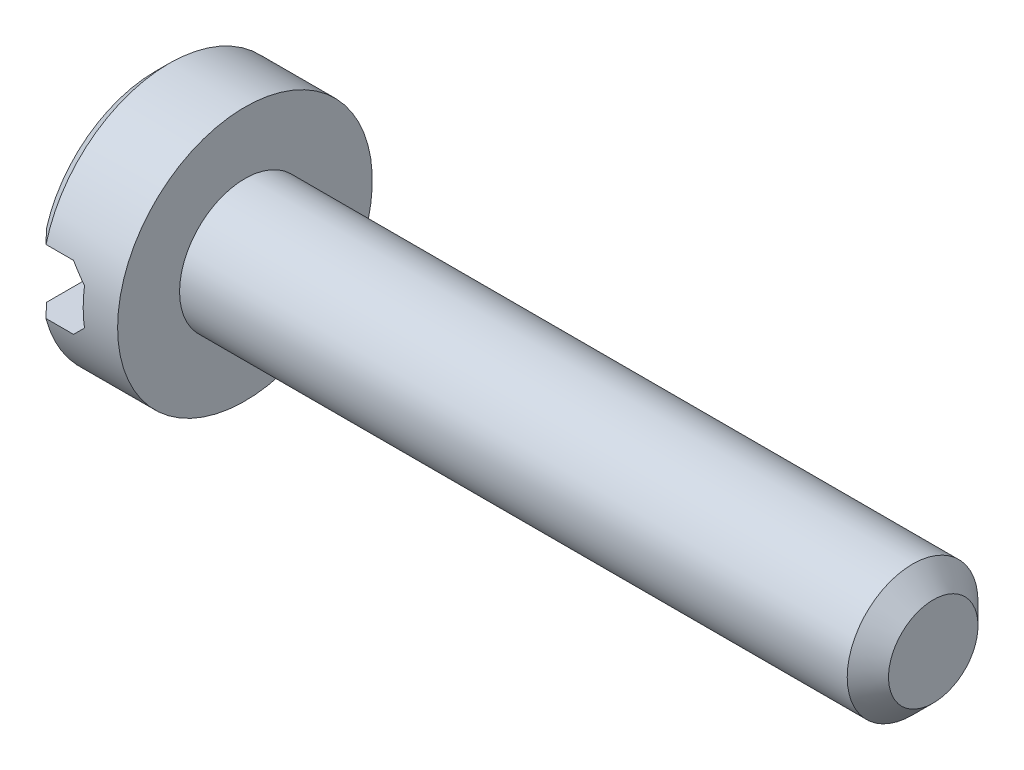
from build123d import *

# Parameters (mm, degrees)
ENL_V_MAT_EXTRU_1_DEPTH = 5
ESQUISSE3_R             = 0.95
EXTRUSION1_DEPTH        = 10
CHANFREIN1_SIZE         = 0.3


with BuildPart() as part:
    # Esquisse1 → R_volution1 (revolve)
    with BuildSketch(Plane.XY, mode=Mode.PRIVATE) as r_volution1_sk:
        Polygon((0, 0), (0, 1.65), (0.2, 1.85), (1.3, 1.85), (1.3, 0), align=None)
    revolve(r_volution1_sk.sketch.rotate(Axis((0, 0, 0), (1, 0, 0)), 90), axis=Axis((0, 0, 0), (1, 0, 0)))

    # Esquisse2 → Enl_v. mat.-Extru.1 (cut, symmetric)
    with BuildSketch(Plane.XY):
        Polygon((0, 0.465549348), (0.6, 0.465549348), (0.8, 0.265549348), (0.8, -0.265549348), (0.6, -0.465549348), (0, -0.465549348), align=None)
    extrude(amount=ENL_V_MAT_EXTRU_1_DEPTH, both=True, mode=Mode.SUBTRACT)

    # Esquisse3 → Extrusion1 (add)
    with BuildSketch(Plane(origin=(1.3, 0, 0), x_dir=(0, 0, -1), z_dir=(1, 0, 0))):
        with Locations(Location((0, 0, 0), (0, 0, 180))):
            Circle(ESQUISSE3_R)
    extrude(amount=EXTRUSION1_DEPTH)

    # Chanfrein1
    chanfrein1_edges = [part.edges().sort_by_distance(p)[0] for p in [
        (11.3, 0, -0.95),
    ]]
    chamfer(chanfrein1_edges, length=CHANFREIN1_SIZE)


solid = part.part
